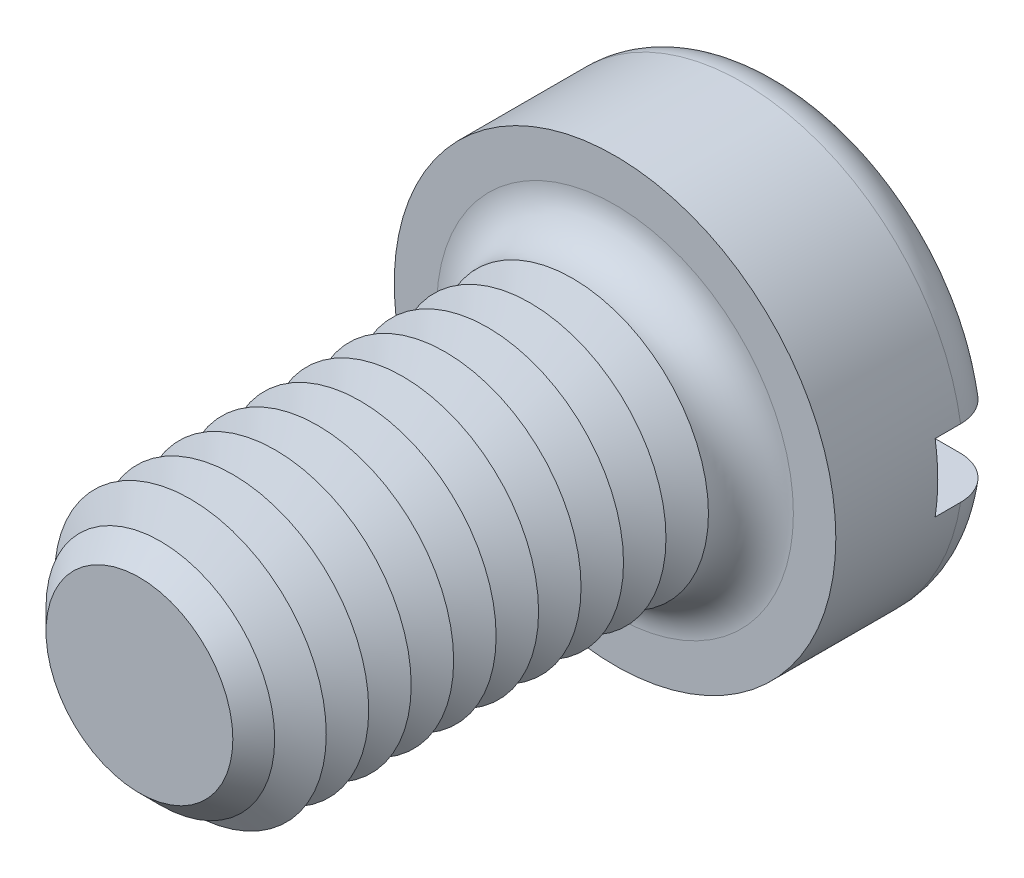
from build123d import *

# Parameters (mm, degrees)
SKETCH3_R           = 6.5
BOSS_EXTRUDE2_DEPTH = 5
SKETCH4_R           = 4
BOSS_EXTRUDE3_DEPTH = 14
FILLET1_R           = 1.25
CHAMFER1_SIZE       = 1.25
LPATTERN1_COUNT     = 10
LPATTERN1_PITCH     = 1.25
SKETCH8_W           = 13
SKETCH8_H           = 2
CUT_EXTRUDE1_DEPTH  = 2


with BuildPart() as part:
    # Sketch3 → Boss-Extrude2 (new body)
    with BuildSketch(Plane.XY):
        Circle(SKETCH3_R)
    extrude(amount=-BOSS_EXTRUDE2_DEPTH)

    # Sketch4 → Boss-Extrude3 (add)
    with BuildSketch(Plane.XY):
        Circle(SKETCH4_R)
    extrude(amount=BOSS_EXTRUDE3_DEPTH)

    # Fillet1
    fillet1_edges = [part.edges().sort_by_distance(p)[0] for p in [
        (-6.5, 0, -5),
        (-4, 0, 0),
    ]]
    fillet(fillet1_edges, radius=FILLET1_R)

    # Chamfer1
    chamfer1_edges = [part.edges().sort_by_distance(p)[0] for p in [
        (-4, 0, 14),
    ]]
    chamfer(chamfer1_edges, length=CHAMFER1_SIZE)

    # Sketch6 → Cut-Revolve1 (revolve, cut)
    with BuildSketch(Plane(origin=(0, 0, 0), x_dir=(0, 0, -1), z_dir=(1, 0, 0)), mode=Mode.PRIVATE) as cut_revolve1_sk:
        Polygon((-1.25, 4), (-1.875, 2.917468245), (-2.5, 4), align=None)
    cut_revolve1 = revolve(cut_revolve1_sk.sketch.rotate(Axis((0, 0, -1.694361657), (0, 0, 1)), 90), axis=Axis((0, 0, -1.694361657), (0, 0, 1)), mode=Mode.SUBTRACT)

    # LPattern1: Cut-Revolve1 ×10
    with Locations(*[(0, 0, i * LPATTERN1_PITCH) for i in range(1, LPATTERN1_COUNT)]):
        add(cut_revolve1, mode=Mode.SUBTRACT)

    # Sketch8 → Cut-Extrude1 (cut)
    with BuildSketch(Plane(origin=(0, 0, -5), x_dir=(-1, 0, 0), z_dir=(0, 0, -1))):
        Rectangle(SKETCH8_W, SKETCH8_H)
    extrude(amount=-CUT_EXTRUDE1_DEPTH, mode=Mode.SUBTRACT)


solid = part.part
